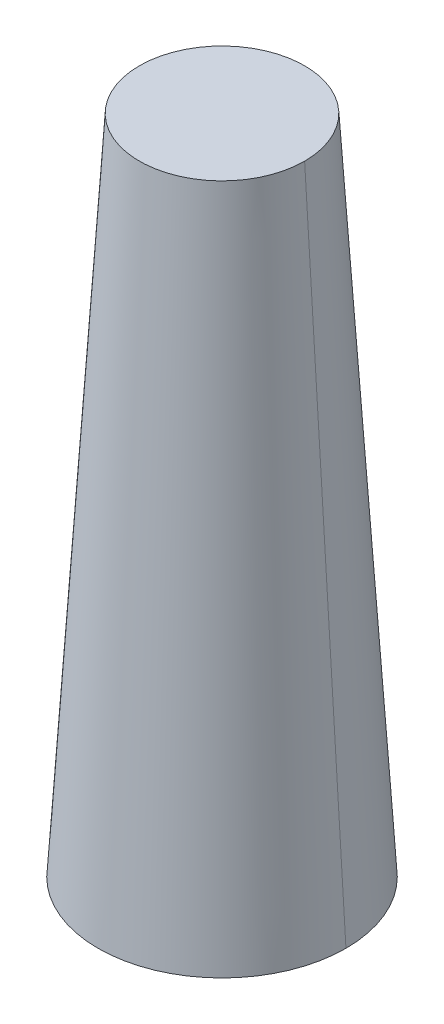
ISO-10303-21;
HEADER;
FILE_DESCRIPTION(('STEP AP214'),'2;1');
FILE_NAME('part.step','',(''),(''),'','','');
FILE_SCHEMA(('AUTOMOTIVE_DESIGN { 1 0 10303 214 1 1 1 1 }'));
ENDSEC;
DATA;
#1=APPLICATION_CONTEXT('core data for automotive mechanical design processes');
#2=APPLICATION_PROTOCOL_DEFINITION('international standard','automotive_design',2000,#1);
#3=PRODUCT_CONTEXT('',#1,'mechanical');
#4=PRODUCT('Part','Part','',(#3));
#5=PRODUCT_RELATED_PRODUCT_CATEGORY('part','',(#4));
#6=PRODUCT_DEFINITION_FORMATION('','',#4);
#7=PRODUCT_DEFINITION_CONTEXT('part definition',#1,'design');
#8=PRODUCT_DEFINITION('design','',#6,#7);
#9=PRODUCT_DEFINITION_SHAPE('','',#8);
#10=(LENGTH_UNIT() NAMED_UNIT(*) SI_UNIT(.MILLI.,.METRE.));
#11=(NAMED_UNIT(*) PLANE_ANGLE_UNIT() SI_UNIT($,.RADIAN.));
#12=(NAMED_UNIT(*) SI_UNIT($,.STERADIAN.) SOLID_ANGLE_UNIT());
#13=UNCERTAINTY_MEASURE_WITH_UNIT(LENGTH_MEASURE(1.E-05),#10,'distance_accuracy_value','');
#14=(GEOMETRIC_REPRESENTATION_CONTEXT(3) GLOBAL_UNCERTAINTY_ASSIGNED_CONTEXT((#13)) GLOBAL_UNIT_ASSIGNED_CONTEXT((#10,
#11,#12)) REPRESENTATION_CONTEXT('',''));
#15=CARTESIAN_POINT('',(0.,0.,0.));
#16=DIRECTION('',(0.,0.,1.));
#17=DIRECTION('',(1.,0.,0.));
#18=AXIS2_PLACEMENT_3D('',#15,#16,#17);
#19=CARTESIAN_POINT('',(4.7625,-25.4,0.));
#20=DIRECTION('',(0.,-1.,0.));
#21=DIRECTION('',(0.,0.,-1.));
#22=AXIS2_PLACEMENT_3D('',#19,#20,#21);
#23=PLANE('',#22);
#24=CARTESIAN_POINT('',(0.,-25.4,0.));
#25=DIRECTION('',(0.,-1.,0.));
#26=DIRECTION('',(0.,0.,-1.));
#27=AXIS2_PLACEMENT_3D('',#24,#25,#26);
#28=CIRCLE('',#27,9.525);
#29=CARTESIAN_POINT('',(9.525,-25.4,0.));
#30=VERTEX_POINT('',#29);
#31=CARTESIAN_POINT('',(-9.525,-25.4,0.));
#32=VERTEX_POINT('',#31);
#33=EDGE_CURVE('E47',#30,#32,#28,.F.);
#34=ORIENTED_EDGE('',*,*,#33,.F.);
#35=CARTESIAN_POINT('',(0.,-25.4,0.));
#36=DIRECTION('',(0.,-1.,0.));
#37=DIRECTION('',(0.,0.,-1.));
#38=AXIS2_PLACEMENT_3D('',#35,#36,#37);
#39=CIRCLE('',#38,9.525);
#40=EDGE_CURVE('E19',#32,#30,#39,.F.);
#41=ORIENTED_EDGE('',*,*,#40,.F.);
#42=EDGE_LOOP('',(#34,#41));
#43=FACE_BOUND('',#42,.T.);
#44=ADVANCED_FACE('F16',(#43),#23,.T.);
#45=CARTESIAN_POINT('',(0.,-25.4,0.));
#46=DIRECTION('',(0.,-1.,0.));
#47=DIRECTION('',(0.,0.,-1.));
#48=AXIS2_PLACEMENT_3D('',#45,#46,#47);
#49=CONICAL_SURFACE('',#48,9.525,0.0624188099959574);
#50=DIRECTION('',(0.0623782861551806,0.998052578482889,0.));
#51=VECTOR('',#50,1.);
#52=CARTESIAN_POINT('',(-7.9375,0.,0.));
#53=LINE('',#52,#51);
#54=CARTESIAN_POINT('',(-6.35,25.4,0.));
#55=VERTEX_POINT('',#54);
#56=EDGE_CURVE('E25',#32,#55,#53,.T.);
#57=ORIENTED_EDGE('',*,*,#56,.F.);
#58=ORIENTED_EDGE('',*,*,#40,.T.);
#59=DIRECTION('',(-0.0623782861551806,0.998052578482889,0.));
#60=VECTOR('',#59,1.);
#61=CARTESIAN_POINT('',(7.9375,0.,0.));
#62=LINE('',#61,#60);
#63=CARTESIAN_POINT('',(6.35,25.4,0.));
#64=VERTEX_POINT('',#63);
#65=EDGE_CURVE('E41',#64,#30,#62,.F.);
#66=ORIENTED_EDGE('',*,*,#65,.F.);
#67=CARTESIAN_POINT('',(0.,25.4,0.));
#68=DIRECTION('',(0.,-1.,0.));
#69=DIRECTION('',(0.,0.,-1.));
#70=AXIS2_PLACEMENT_3D('',#67,#68,#69);
#71=CIRCLE('',#70,6.35);
#72=EDGE_CURVE('E34',#55,#64,#71,.F.);
#73=ORIENTED_EDGE('',*,*,#72,.F.);
#74=EDGE_LOOP('',(#57,#58,#66,#73));
#75=FACE_BOUND('',#74,.T.);
#76=ADVANCED_FACE('F43',(#75),#49,.T.);
#77=CARTESIAN_POINT('',(3.175,25.4,0.));
#78=DIRECTION('',(0.,1.,0.));
#79=DIRECTION('',(0.,0.,1.));
#80=AXIS2_PLACEMENT_3D('',#77,#78,#79);
#81=PLANE('',#80);
#82=CARTESIAN_POINT('',(0.,25.4,0.));
#83=DIRECTION('',(0.,-1.,0.));
#84=DIRECTION('',(0.,0.,-1.));
#85=AXIS2_PLACEMENT_3D('',#82,#83,#84);
#86=CIRCLE('',#85,6.35);
#87=EDGE_CURVE('E11',#55,#64,#86,.T.);
#88=ORIENTED_EDGE('',*,*,#87,.F.);
#89=ORIENTED_EDGE('',*,*,#72,.T.);
#90=EDGE_LOOP('',(#88,#89));
#91=FACE_BOUND('',#90,.T.);
#92=ADVANCED_FACE('F54',(#91),#81,.T.);
#93=CARTESIAN_POINT('',(0.,-25.4,0.));
#94=DIRECTION('',(0.,-1.,0.));
#95=DIRECTION('',(0.,0.,-1.));
#96=AXIS2_PLACEMENT_3D('',#93,#94,#95);
#97=CONICAL_SURFACE('',#96,9.525,0.0624188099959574);
#98=ORIENTED_EDGE('',*,*,#56,.T.);
#99=ORIENTED_EDGE('',*,*,#87,.T.);
#100=ORIENTED_EDGE('',*,*,#65,.T.);
#101=ORIENTED_EDGE('',*,*,#33,.T.);
#102=EDGE_LOOP('',(#98,#99,#100,#101));
#103=FACE_BOUND('',#102,.T.);
#104=ADVANCED_FACE('F50',(#103),#97,.T.);
#105=CLOSED_SHELL('',(#44,#76,#92,#104));
#106=MANIFOLD_SOLID_BREP('B1',#105);
#107=ADVANCED_BREP_SHAPE_REPRESENTATION('',(#18,#106),#14);
#108=SHAPE_DEFINITION_REPRESENTATION(#9,#107);
ENDSEC;
END-ISO-10303-21;
